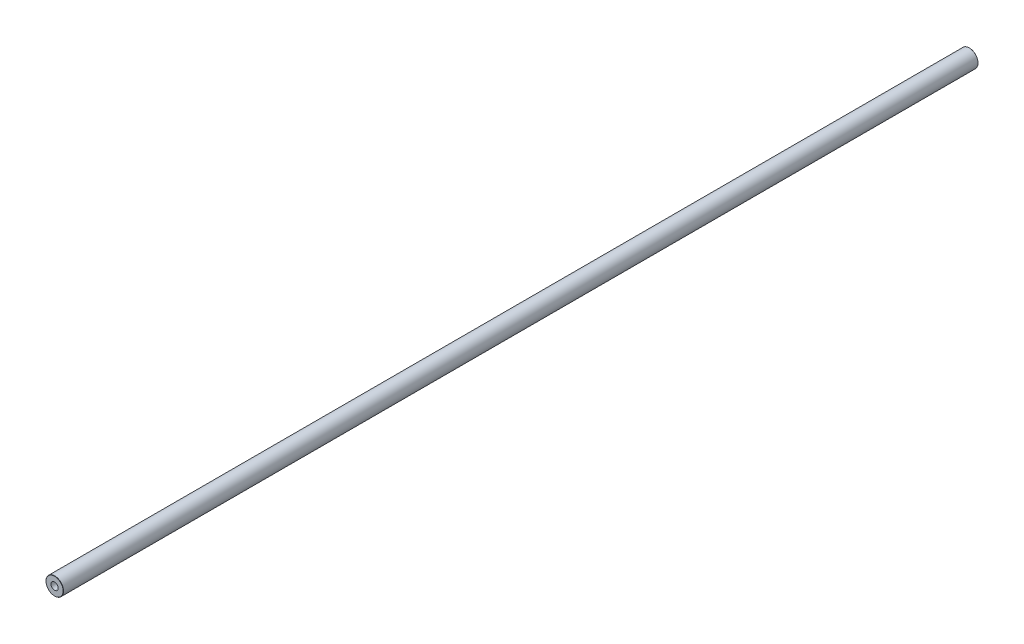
from build123d import *

# Parameters (mm, degrees)
ESQUISSE1_R               = 4
BOSS_EXTRU_1_DEPTH        = 416.9
TROU_TARAUD_M4X0_71_D     = 3.3
TROU_TARAUD_M4X0_71_DEPTH = 20
TROU_TARAUD_M4X0_71_TIP   = 0.991420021
TROU_TARAUD_M4X0_72_D     = 3.3
TROU_TARAUD_M4X0_72_DEPTH = 20
TROU_TARAUD_M4X0_72_TIP   = 0.991420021
CHANFREIN1_SIZE           = 0.1


with BuildPart() as part:
    # Esquisse1 → Boss.-Extru.1 (new body)
    with BuildSketch(Plane.XY):
        Circle(ESQUISSE1_R)
    extrude(amount=BOSS_EXTRU_1_DEPTH)

    # Trou taraud_ M4x0.71
    with Locations(Plane(origin=(0, 0, 0), x_dir=(-1, 0, 0), z_dir=(0, 0, -1))):
        with Locations((0, 0)):
            Hole(TROU_TARAUD_M4X0_71_D / 2, depth=TROU_TARAUD_M4X0_71_DEPTH)
            with Locations((0, 0, -(TROU_TARAUD_M4X0_71_DEPTH + TROU_TARAUD_M4X0_71_TIP / 2))):  # 118° drill point
                Cone(0, TROU_TARAUD_M4X0_71_D / 2, TROU_TARAUD_M4X0_71_TIP, mode=Mode.SUBTRACT)

    # Trou taraud_ M4x0.72
    with Locations(Plane.XY.offset(416.9)):
        with Locations((0, 0)):
            Hole(TROU_TARAUD_M4X0_72_D / 2, depth=TROU_TARAUD_M4X0_72_DEPTH)
            with Locations((0, 0, -(TROU_TARAUD_M4X0_72_DEPTH + TROU_TARAUD_M4X0_72_TIP / 2))):  # 118° drill point
                Cone(0, TROU_TARAUD_M4X0_72_D / 2, TROU_TARAUD_M4X0_72_TIP, mode=Mode.SUBTRACT)

    # Chanfrein1
    chanfrein1_edges = [part.edges().sort_by_distance(p)[0] for p in [
        (-4, 0, 0),
        (-4, 0, 416.9),
    ]]
    chamfer(chanfrein1_edges, length=CHANFREIN1_SIZE)


solid = part.part
